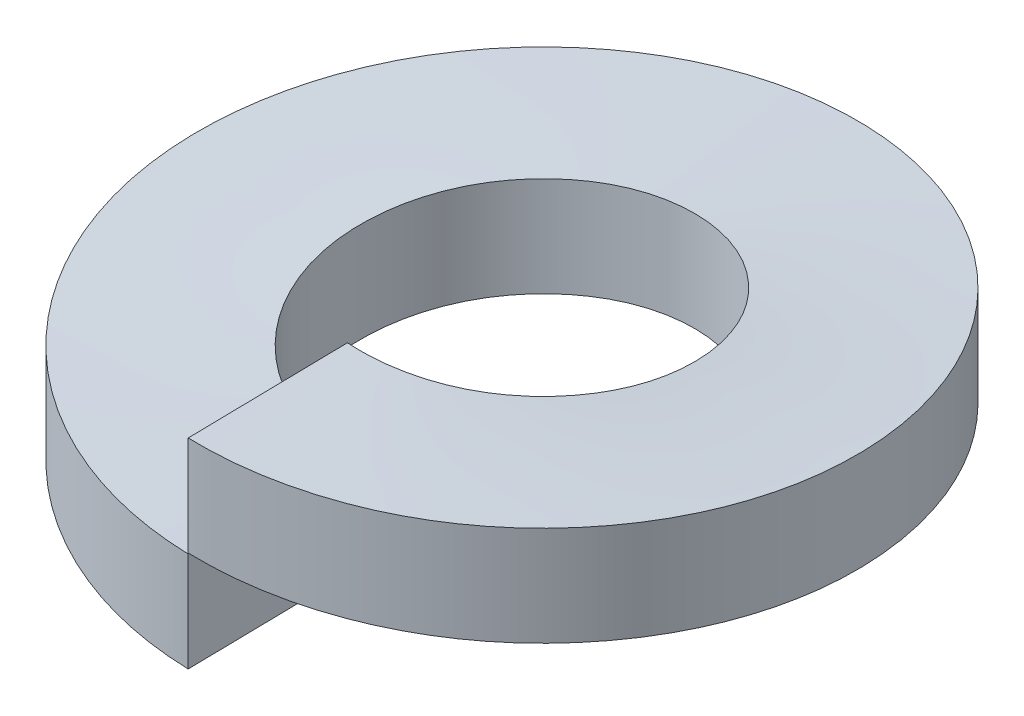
ISO-10303-21;
HEADER;
FILE_DESCRIPTION(('STEP AP214'),'2;1');
FILE_NAME('part.step','',(''),(''),'','','');
FILE_SCHEMA(('AUTOMOTIVE_DESIGN { 1 0 10303 214 1 1 1 1 }'));
ENDSEC;
DATA;
#1=APPLICATION_CONTEXT('core data for automotive mechanical design processes');
#2=APPLICATION_PROTOCOL_DEFINITION('international standard','automotive_design',2000,#1);
#3=PRODUCT_CONTEXT('',#1,'mechanical');
#4=PRODUCT('Part','Part','',(#3));
#5=PRODUCT_RELATED_PRODUCT_CATEGORY('part','',(#4));
#6=PRODUCT_DEFINITION_FORMATION('','',#4);
#7=PRODUCT_DEFINITION_CONTEXT('part definition',#1,'design');
#8=PRODUCT_DEFINITION('design','',#6,#7);
#9=PRODUCT_DEFINITION_SHAPE('','',#8);
#10=(LENGTH_UNIT() NAMED_UNIT(*) SI_UNIT(.MILLI.,.METRE.));
#11=(NAMED_UNIT(*) PLANE_ANGLE_UNIT() SI_UNIT($,.RADIAN.));
#12=(NAMED_UNIT(*) SI_UNIT($,.STERADIAN.) SOLID_ANGLE_UNIT());
#13=UNCERTAINTY_MEASURE_WITH_UNIT(LENGTH_MEASURE(1.E-05),#10,'distance_accuracy_value','');
#14=(GEOMETRIC_REPRESENTATION_CONTEXT(3) GLOBAL_UNCERTAINTY_ASSIGNED_CONTEXT((#13)) GLOBAL_UNIT_ASSIGNED_CONTEXT((#10,
#11,#12)) REPRESENTATION_CONTEXT('',''));
#15=CARTESIAN_POINT('',(0.,0.,0.));
#16=DIRECTION('',(0.,0.,1.));
#17=DIRECTION('',(1.,0.,0.));
#18=AXIS2_PLACEMENT_3D('',#15,#16,#17);
#19=CARTESIAN_POINT('',(0.0349050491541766,0.591666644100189,1.99969538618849));
#20=DIRECTION('',(0.999847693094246,0.,-0.0174525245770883));
#21=DIRECTION('',(-0.0174525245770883,0.,-0.999847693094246));
#22=AXIS2_PLACEMENT_3D('',#19,#20,#21);
#23=PLANE('',#22);
#24=DIRECTION('',(0.,1.,0.));
#25=VECTOR('',#24,1.);
#26=CARTESIAN_POINT('',(0.0349050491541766,0.591666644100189,1.99969538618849));
#27=LINE('',#26,#25);
#28=CARTESIAN_POINT('',(0.0349050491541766,-0.00333335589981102,1.99969538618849));
#29=VERTEX_POINT('',#28);
#30=CARTESIAN_POINT('',(0.0349050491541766,1.18666664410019,1.99969538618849));
#31=VERTEX_POINT('',#30);
#32=EDGE_CURVE('E44',#29,#31,#27,.T.);
#33=ORIENTED_EDGE('',*,*,#32,.T.);
#34=DIRECTION('',(0.0174525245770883,0.,0.999847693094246));
#35=VECTOR('',#34,1.);
#36=CARTESIAN_POINT('',(0.0518025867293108,1.18666664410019,2.96774811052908));
#37=LINE('',#36,#35);
#38=CARTESIAN_POINT('',(0.0687001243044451,1.18666664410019,3.93580083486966));
#39=VERTEX_POINT('',#38);
#40=EDGE_CURVE('E39',#31,#39,#37,.T.);
#41=ORIENTED_EDGE('',*,*,#40,.T.);
#42=DIRECTION('',(0.,-1.,0.));
#43=VECTOR('',#42,1.);
#44=CARTESIAN_POINT('',(0.0687001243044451,0.591666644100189,3.93580083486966));
#45=LINE('',#44,#43);
#46=CARTESIAN_POINT('',(0.0687001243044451,-0.00333335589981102,3.93580083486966));
#47=VERTEX_POINT('',#46);
#48=EDGE_CURVE('E79',#39,#47,#45,.T.);
#49=ORIENTED_EDGE('',*,*,#48,.T.);
#50=DIRECTION('',(-0.0174525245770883,0.,-0.999847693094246));
#51=VECTOR('',#50,1.);
#52=CARTESIAN_POINT('',(0.0518025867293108,-0.00333335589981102,2.96774811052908));
#53=LINE('',#52,#51);
#54=EDGE_CURVE('E60',#47,#29,#53,.T.);
#55=ORIENTED_EDGE('',*,*,#54,.T.);
#56=EDGE_LOOP('',(#33,#41,#49,#55));
#57=FACE_BOUND('',#56,.T.);
#58=ADVANCED_FACE('F35',(#57),#23,.T.);
#59=CARTESIAN_POINT('',(0.0349050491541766,1.79166664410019,1.99969538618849));
#60=DIRECTION('',(-0.999847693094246,0.,0.0174525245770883));
#61=DIRECTION('',(0.0174525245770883,0.,0.999847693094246));
#62=AXIS2_PLACEMENT_3D('',#59,#60,#61);
#63=PLANE('',#62);
#64=DIRECTION('',(0.,-1.,0.));
#65=VECTOR('',#64,1.);
#66=CARTESIAN_POINT('',(0.0349050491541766,1.79166664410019,1.99969538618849));
#67=LINE('',#66,#65);
#68=CARTESIAN_POINT('',(0.0349050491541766,2.38666664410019,1.99969538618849));
#69=VERTEX_POINT('',#68);
#70=CARTESIAN_POINT('',(0.0349050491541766,1.19666664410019,1.99969538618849));
#71=VERTEX_POINT('',#70);
#72=EDGE_CURVE('E11',#69,#71,#67,.T.);
#73=ORIENTED_EDGE('',*,*,#72,.T.);
#74=DIRECTION('',(0.0174525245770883,0.,0.999847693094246));
#75=VECTOR('',#74,1.);
#76=CARTESIAN_POINT('',(0.0518025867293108,1.19666664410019,2.96774811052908));
#77=LINE('',#76,#75);
#78=CARTESIAN_POINT('',(0.0687001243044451,1.19666664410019,3.93580083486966));
#79=VERTEX_POINT('',#78);
#80=EDGE_CURVE('E184',#71,#79,#77,.T.);
#81=ORIENTED_EDGE('',*,*,#80,.T.);
#82=DIRECTION('',(0.,1.,0.));
#83=VECTOR('',#82,1.);
#84=CARTESIAN_POINT('',(0.0687001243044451,1.79166664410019,3.93580083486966));
#85=LINE('',#84,#83);
#86=CARTESIAN_POINT('',(0.0687001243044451,2.38666664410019,3.93580083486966));
#87=VERTEX_POINT('',#86);
#88=EDGE_CURVE('E96',#79,#87,#85,.T.);
#89=ORIENTED_EDGE('',*,*,#88,.T.);
#90=DIRECTION('',(-0.0174525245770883,0.,-0.999847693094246));
#91=VECTOR('',#90,1.);
#92=CARTESIAN_POINT('',(0.0518025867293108,2.38666664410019,2.96774811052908));
#93=LINE('',#92,#91);
#94=EDGE_CURVE('E84',#87,#69,#93,.T.);
#95=ORIENTED_EDGE('',*,*,#94,.T.);
#96=EDGE_LOOP('',(#73,#81,#89,#95));
#97=FACE_BOUND('',#96,.T.);
#98=ADVANCED_FACE('F37',(#97),#63,.T.);
#99=CARTESIAN_POINT('',(0.0349050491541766,-0.00333335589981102,1.99969538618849));
#100=CARTESIAN_POINT('',(-0.793395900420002,0.071666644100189,2.01415353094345));
#101=CARTESIAN_POINT('',(-1.38931657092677,0.146666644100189,1.4386797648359));
#102=CARTESIAN_POINT('',(-1.98523724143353,0.221666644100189,0.863205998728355));
#103=CARTESIAN_POINT('',(-1.99969538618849,0.296666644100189,0.0349050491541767));
#104=CARTESIAN_POINT('',(-2.01415353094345,0.371666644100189,-0.793395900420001));
#105=CARTESIAN_POINT('',(-1.4386797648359,0.446666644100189,-1.38931657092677));
#106=CARTESIAN_POINT('',(-0.863205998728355,0.521666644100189,-1.98523724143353));
#107=CARTESIAN_POINT('',(-0.0349050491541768,0.596666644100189,-1.99969538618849));
#108=CARTESIAN_POINT('',(0.793395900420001,0.671666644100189,-2.01415353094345));
#109=CARTESIAN_POINT('',(1.38931657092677,0.746666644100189,-1.4386797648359));
#110=CARTESIAN_POINT('',(1.98523724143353,0.821666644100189,-0.863205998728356));
#111=CARTESIAN_POINT('',(1.99969538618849,0.896666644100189,-0.0349050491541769));
#112=CARTESIAN_POINT('',(2.01415353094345,0.971666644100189,0.793395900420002));
#113=CARTESIAN_POINT('',(1.4386797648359,1.04666664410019,1.38931657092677));
#114=CARTESIAN_POINT('',(0.863205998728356,1.12166664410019,1.98523724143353));
#115=CARTESIAN_POINT('',(0.0349050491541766,1.19666664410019,1.99969538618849));
#116=CARTESIAN_POINT('',(0.0349050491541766,1.18666664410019,1.99969538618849));
#117=CARTESIAN_POINT('',(-0.793395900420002,1.26166664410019,2.01415353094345));
#118=CARTESIAN_POINT('',(-1.38931657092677,1.33666664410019,1.4386797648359));
#119=CARTESIAN_POINT('',(-1.98523724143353,1.41166664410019,0.863205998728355));
#120=CARTESIAN_POINT('',(-1.99969538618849,1.48666664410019,0.0349050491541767));
#121=CARTESIAN_POINT('',(-2.01415353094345,1.56166664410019,-0.793395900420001));
#122=CARTESIAN_POINT('',(-1.4386797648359,1.63666664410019,-1.38931657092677));
#123=CARTESIAN_POINT('',(-0.863205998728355,1.71166664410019,-1.98523724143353));
#124=CARTESIAN_POINT('',(-0.0349050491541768,1.78666664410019,-1.99969538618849));
#125=CARTESIAN_POINT('',(0.793395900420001,1.86166664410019,-2.01415353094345));
#126=CARTESIAN_POINT('',(1.38931657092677,1.93666664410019,-1.4386797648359));
#127=CARTESIAN_POINT('',(1.98523724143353,2.01166664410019,-0.863205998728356));
#128=CARTESIAN_POINT('',(1.99969538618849,2.08666664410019,-0.0349050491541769));
#129=CARTESIAN_POINT('',(2.01415353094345,2.16166664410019,0.793395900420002));
#130=CARTESIAN_POINT('',(1.4386797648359,2.23666664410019,1.38931657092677));
#131=CARTESIAN_POINT('',(0.863205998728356,2.31166664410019,1.98523724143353));
#132=CARTESIAN_POINT('',(0.0349050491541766,2.38666664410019,1.99969538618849));
#133=(BOUNDED_SURFACE() B_SPLINE_SURFACE(1,2,((#99,#100,#101,#102,#103,#104,#105,#106,#107,#108,
#109,#110,#111,#112,#113,#114,#115),(#116,#117,#118,#119,#120,#121,#122,#123,#124,#125,#126,
#127,#128,#129,#130,#131,#132)),.UNSPECIFIED.,.F.,.F.,.F.) B_SPLINE_SURFACE_WITH_KNOTS((2,2),(3,
2,2,2,2,2,2,2,3),(0.,1.),(0.,0.125,0.25,0.375,0.5,0.625,0.75,0.875,1.),
.UNSPECIFIED.) GEOMETRIC_REPRESENTATION_ITEM() RATIONAL_B_SPLINE_SURFACE(((1.,0.923879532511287,
1.,0.923879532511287,1.,0.923879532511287,1.,0.923879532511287,1.,0.923879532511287,1.,
0.923879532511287,1.,0.923879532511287,1.,0.923879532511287,1.),(1.,0.923879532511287,1.,
0.923879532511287,1.,0.923879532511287,1.,0.923879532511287,1.,0.923879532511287,1.,
0.923879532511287,1.,0.923879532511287,1.,0.923879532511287,1.))) REPRESENTATION_ITEM('') SURFACE());
#134=CARTESIAN_POINT('',(0.0349050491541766,-0.00333335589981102,1.99969538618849));
#135=CARTESIAN_POINT('',(-0.793395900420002,0.071666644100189,2.01415353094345));
#136=CARTESIAN_POINT('',(-1.38931657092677,0.146666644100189,1.4386797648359));
#137=CARTESIAN_POINT('',(-1.98523724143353,0.221666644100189,0.863205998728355));
#138=CARTESIAN_POINT('',(-1.99969538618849,0.296666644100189,0.0349050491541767));
#139=CARTESIAN_POINT('',(-2.01415353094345,0.371666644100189,-0.793395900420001));
#140=CARTESIAN_POINT('',(-1.4386797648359,0.446666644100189,-1.38931657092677));
#141=CARTESIAN_POINT('',(-0.863205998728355,0.521666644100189,-1.98523724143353));
#142=CARTESIAN_POINT('',(-0.0349050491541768,0.596666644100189,-1.99969538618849));
#143=CARTESIAN_POINT('',(0.793395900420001,0.671666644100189,-2.01415353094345));
#144=CARTESIAN_POINT('',(1.38931657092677,0.746666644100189,-1.4386797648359));
#145=CARTESIAN_POINT('',(1.98523724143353,0.821666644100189,-0.863205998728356));
#146=CARTESIAN_POINT('',(1.99969538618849,0.896666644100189,-0.0349050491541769));
#147=CARTESIAN_POINT('',(2.01415353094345,0.971666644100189,0.793395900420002));
#148=CARTESIAN_POINT('',(1.4386797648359,1.04666664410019,1.38931657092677));
#149=CARTESIAN_POINT('',(0.863205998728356,1.12166664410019,1.98523724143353));
#150=CARTESIAN_POINT('',(0.0349050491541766,1.19666664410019,1.99969538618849));
#151=(BOUNDED_CURVE() B_SPLINE_CURVE(2,(#134,#135,#136,#137,#138,#139,#140,#141,#142,#143,#144,
#145,#146,#147,#148,#149,#150),.UNSPECIFIED.,.F.,.F.) B_SPLINE_CURVE_WITH_KNOTS((3,2,2,2,2,2,2,
2,3),(0.,0.125,0.25,0.375,0.5,0.625,0.75,0.875,1.),
.UNSPECIFIED.) CURVE() GEOMETRIC_REPRESENTATION_ITEM() RATIONAL_B_SPLINE_CURVE((1.,
0.923879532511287,1.,0.923879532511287,1.,0.923879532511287,1.,0.923879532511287,1.,
0.923879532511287,1.,0.923879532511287,1.,0.923879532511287,1.,0.923879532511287,1.)) REPRESENTATION_ITEM(''));
#152=EDGE_CURVE('E52',#29,#71,#151,.T.);
#153=CARTESIAN_POINT('',(0.0349050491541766,1.18666664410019,1.99969538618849));
#154=CARTESIAN_POINT('',(-0.793395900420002,1.26166664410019,2.01415353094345));
#155=CARTESIAN_POINT('',(-1.38931657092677,1.33666664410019,1.4386797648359));
#156=CARTESIAN_POINT('',(-1.98523724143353,1.41166664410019,0.863205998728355));
#157=CARTESIAN_POINT('',(-1.99969538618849,1.48666664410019,0.0349050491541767));
#158=CARTESIAN_POINT('',(-2.01415353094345,1.56166664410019,-0.793395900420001));
#159=CARTESIAN_POINT('',(-1.4386797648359,1.63666664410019,-1.38931657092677));
#160=CARTESIAN_POINT('',(-0.863205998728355,1.71166664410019,-1.98523724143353));
#161=CARTESIAN_POINT('',(-0.0349050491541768,1.78666664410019,-1.99969538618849));
#162=CARTESIAN_POINT('',(0.793395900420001,1.86166664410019,-2.01415353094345));
#163=CARTESIAN_POINT('',(1.38931657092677,1.93666664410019,-1.4386797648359));
#164=CARTESIAN_POINT('',(1.98523724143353,2.01166664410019,-0.863205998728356));
#165=CARTESIAN_POINT('',(1.99969538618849,2.08666664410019,-0.0349050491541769));
#166=CARTESIAN_POINT('',(2.01415353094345,2.16166664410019,0.793395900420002));
#167=CARTESIAN_POINT('',(1.4386797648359,2.23666664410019,1.38931657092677));
#168=CARTESIAN_POINT('',(0.863205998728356,2.31166664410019,1.98523724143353));
#169=CARTESIAN_POINT('',(0.0349050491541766,2.38666664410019,1.99969538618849));
#170=(BOUNDED_CURVE() B_SPLINE_CURVE(2,(#153,#154,#155,#156,#157,#158,#159,#160,#161,#162,#163,
#164,#165,#166,#167,#168,#169),.UNSPECIFIED.,.F.,.F.) B_SPLINE_CURVE_WITH_KNOTS((3,2,2,2,2,2,2,
2,3),(0.,0.125,0.25,0.375,0.5,0.625,0.75,0.875,1.),
.UNSPECIFIED.) CURVE() GEOMETRIC_REPRESENTATION_ITEM() RATIONAL_B_SPLINE_CURVE((1.,
0.923879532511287,1.,0.923879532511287,1.,0.923879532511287,1.,0.923879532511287,1.,
0.923879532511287,1.,0.923879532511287,1.,0.923879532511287,1.,0.923879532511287,1.)) REPRESENTATION_ITEM(''));
#171=EDGE_CURVE('E91',#31,#69,#170,.T.);
#172=ORIENTED_EDGE('',*,*,#32,.F.);
#173=ORIENTED_EDGE('',*,*,#152,.T.);
#174=ORIENTED_EDGE('',*,*,#72,.F.);
#175=ORIENTED_EDGE('',*,*,#171,.F.);
#176=EDGE_LOOP('',(#172,#173,#174,#175));
#177=FACE_BOUND('',#176,.T.);
#178=ADVANCED_FACE('F103',(#177),#133,.F.);
#179=CARTESIAN_POINT('',(0.0687001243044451,-0.00333335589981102,3.93580083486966));
#180=CARTESIAN_POINT('',(-1.56156196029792,0.071666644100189,3.96425735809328));
#181=CARTESIAN_POINT('',(-2.73445313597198,0.146666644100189,2.83160978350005));
#182=CARTESIAN_POINT('',(-3.90734431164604,0.221666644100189,1.69896220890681));
#183=CARTESIAN_POINT('',(-3.93580083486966,0.296666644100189,0.0687001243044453));
#184=CARTESIAN_POINT('',(-3.96425735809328,0.371666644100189,-1.56156196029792));
#185=CARTESIAN_POINT('',(-2.83160978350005,0.446666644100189,-2.73445313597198));
#186=CARTESIAN_POINT('',(-1.69896220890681,0.521666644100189,-3.90734431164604));
#187=CARTESIAN_POINT('',(-0.0687001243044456,0.596666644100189,-3.93580083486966));
#188=CARTESIAN_POINT('',(1.56156196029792,0.671666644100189,-3.96425735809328));
#189=CARTESIAN_POINT('',(2.73445313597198,0.746666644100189,-2.83160978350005));
#190=CARTESIAN_POINT('',(3.90734431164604,0.821666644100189,-1.69896220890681));
#191=CARTESIAN_POINT('',(3.93580083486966,0.896666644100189,-0.0687001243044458));
#192=CARTESIAN_POINT('',(3.96425735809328,0.971666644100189,1.56156196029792));
#193=CARTESIAN_POINT('',(2.83160978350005,1.04666664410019,2.73445313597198));
#194=CARTESIAN_POINT('',(1.69896220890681,1.12166664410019,3.90734431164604));
#195=CARTESIAN_POINT('',(0.0687001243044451,1.19666664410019,3.93580083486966));
#196=CARTESIAN_POINT('',(0.0349050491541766,-0.00333335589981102,1.99969538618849));
#197=CARTESIAN_POINT('',(-0.793395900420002,0.071666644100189,2.01415353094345));
#198=CARTESIAN_POINT('',(-1.38931657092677,0.146666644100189,1.4386797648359));
#199=CARTESIAN_POINT('',(-1.98523724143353,0.221666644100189,0.863205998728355));
#200=CARTESIAN_POINT('',(-1.99969538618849,0.296666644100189,0.0349050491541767));
#201=CARTESIAN_POINT('',(-2.01415353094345,0.371666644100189,-0.793395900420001));
#202=CARTESIAN_POINT('',(-1.4386797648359,0.446666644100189,-1.38931657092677));
#203=CARTESIAN_POINT('',(-0.863205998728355,0.521666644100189,-1.98523724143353));
#204=CARTESIAN_POINT('',(-0.0349050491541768,0.596666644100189,-1.99969538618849));
#205=CARTESIAN_POINT('',(0.793395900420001,0.671666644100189,-2.01415353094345));
#206=CARTESIAN_POINT('',(1.38931657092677,0.746666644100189,-1.4386797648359));
#207=CARTESIAN_POINT('',(1.98523724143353,0.821666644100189,-0.863205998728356));
#208=CARTESIAN_POINT('',(1.99969538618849,0.896666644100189,-0.0349050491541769));
#209=CARTESIAN_POINT('',(2.01415353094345,0.971666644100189,0.793395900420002));
#210=CARTESIAN_POINT('',(1.4386797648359,1.04666664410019,1.38931657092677));
#211=CARTESIAN_POINT('',(0.863205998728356,1.12166664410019,1.98523724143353));
#212=CARTESIAN_POINT('',(0.0349050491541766,1.19666664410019,1.99969538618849));
#213=(BOUNDED_SURFACE() B_SPLINE_SURFACE(1,2,((#179,#180,#181,#182,#183,#184,#185,#186,#187,
#188,#189,#190,#191,#192,#193,#194,#195),(#196,#197,#198,#199,#200,#201,#202,#203,#204,#205,
#206,#207,#208,#209,#210,#211,#212)),.UNSPECIFIED.,.F.,.F.,.F.) B_SPLINE_SURFACE_WITH_KNOTS((2,
2),(3,2,2,2,2,2,2,2,3),(0.,1.),(0.,0.125,0.25,0.375,0.5,0.625,0.75,0.875,1.),
.UNSPECIFIED.) GEOMETRIC_REPRESENTATION_ITEM() RATIONAL_B_SPLINE_SURFACE(((1.,0.923879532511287,
1.,0.923879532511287,1.,0.923879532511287,1.,0.923879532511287,1.,0.923879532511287,1.,
0.923879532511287,1.,0.923879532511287,1.,0.923879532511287,1.),(1.,0.923879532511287,1.,
0.923879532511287,1.,0.923879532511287,1.,0.923879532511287,1.,0.923879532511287,1.,
0.923879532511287,1.,0.923879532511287,1.,0.923879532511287,1.))) REPRESENTATION_ITEM('') SURFACE());
#214=CARTESIAN_POINT('',(0.0687001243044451,-0.00333335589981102,3.93580083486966));
#215=CARTESIAN_POINT('',(-1.56156196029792,0.071666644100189,3.96425735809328));
#216=CARTESIAN_POINT('',(-2.73445313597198,0.146666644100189,2.83160978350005));
#217=CARTESIAN_POINT('',(-3.90734431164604,0.221666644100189,1.69896220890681));
#218=CARTESIAN_POINT('',(-3.93580083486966,0.296666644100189,0.0687001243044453));
#219=CARTESIAN_POINT('',(-3.96425735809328,0.371666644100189,-1.56156196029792));
#220=CARTESIAN_POINT('',(-2.83160978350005,0.446666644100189,-2.73445313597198));
#221=CARTESIAN_POINT('',(-1.69896220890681,0.521666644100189,-3.90734431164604));
#222=CARTESIAN_POINT('',(-0.0687001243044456,0.596666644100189,-3.93580083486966));
#223=CARTESIAN_POINT('',(1.56156196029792,0.671666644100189,-3.96425735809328));
#224=CARTESIAN_POINT('',(2.73445313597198,0.746666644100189,-2.83160978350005));
#225=CARTESIAN_POINT('',(3.90734431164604,0.821666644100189,-1.69896220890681));
#226=CARTESIAN_POINT('',(3.93580083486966,0.896666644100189,-0.0687001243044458));
#227=CARTESIAN_POINT('',(3.96425735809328,0.971666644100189,1.56156196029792));
#228=CARTESIAN_POINT('',(2.83160978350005,1.04666664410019,2.73445313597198));
#229=CARTESIAN_POINT('',(1.69896220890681,1.12166664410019,3.90734431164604));
#230=CARTESIAN_POINT('',(0.0687001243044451,1.19666664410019,3.93580083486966));
#231=(BOUNDED_CURVE() B_SPLINE_CURVE(2,(#214,#215,#216,#217,#218,#219,#220,#221,#222,#223,#224,
#225,#226,#227,#228,#229,#230),.UNSPECIFIED.,.F.,.F.) B_SPLINE_CURVE_WITH_KNOTS((3,2,2,2,2,2,2,
2,3),(0.,0.125,0.25,0.375,0.5,0.625,0.75,0.875,1.),
.UNSPECIFIED.) CURVE() GEOMETRIC_REPRESENTATION_ITEM() RATIONAL_B_SPLINE_CURVE((1.,
0.923879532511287,1.,0.923879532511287,1.,0.923879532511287,1.,0.923879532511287,1.,
0.923879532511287,1.,0.923879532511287,1.,0.923879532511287,1.,0.923879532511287,1.)) REPRESENTATION_ITEM(''));
#232=EDGE_CURVE('E94',#47,#79,#231,.T.);
#233=ORIENTED_EDGE('',*,*,#54,.F.);
#234=ORIENTED_EDGE('',*,*,#232,.T.);
#235=ORIENTED_EDGE('',*,*,#80,.F.);
#236=ORIENTED_EDGE('',*,*,#152,.F.);
#237=EDGE_LOOP('',(#233,#234,#235,#236));
#238=FACE_BOUND('',#237,.T.);
#239=ADVANCED_FACE('F105',(#238),#213,.F.);
#240=CARTESIAN_POINT('',(0.0687001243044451,1.18666664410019,3.93580083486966));
#241=CARTESIAN_POINT('',(-1.56156196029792,1.26166664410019,3.96425735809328));
#242=CARTESIAN_POINT('',(-2.73445313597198,1.33666664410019,2.83160978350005));
#243=CARTESIAN_POINT('',(-3.90734431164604,1.41166664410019,1.69896220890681));
#244=CARTESIAN_POINT('',(-3.93580083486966,1.48666664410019,0.0687001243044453));
#245=CARTESIAN_POINT('',(-3.96425735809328,1.56166664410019,-1.56156196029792));
#246=CARTESIAN_POINT('',(-2.83160978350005,1.63666664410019,-2.73445313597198));
#247=CARTESIAN_POINT('',(-1.69896220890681,1.71166664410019,-3.90734431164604));
#248=CARTESIAN_POINT('',(-0.0687001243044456,1.78666664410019,-3.93580083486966));
#249=CARTESIAN_POINT('',(1.56156196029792,1.86166664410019,-3.96425735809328));
#250=CARTESIAN_POINT('',(2.73445313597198,1.93666664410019,-2.83160978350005));
#251=CARTESIAN_POINT('',(3.90734431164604,2.01166664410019,-1.69896220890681));
#252=CARTESIAN_POINT('',(3.93580083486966,2.08666664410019,-0.0687001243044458));
#253=CARTESIAN_POINT('',(3.96425735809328,2.16166664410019,1.56156196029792));
#254=CARTESIAN_POINT('',(2.83160978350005,2.23666664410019,2.73445313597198));
#255=CARTESIAN_POINT('',(1.69896220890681,2.31166664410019,3.90734431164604));
#256=CARTESIAN_POINT('',(0.0687001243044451,2.38666664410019,3.93580083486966));
#257=CARTESIAN_POINT('',(0.0687001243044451,-0.00333335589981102,3.93580083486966));
#258=CARTESIAN_POINT('',(-1.56156196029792,0.071666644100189,3.96425735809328));
#259=CARTESIAN_POINT('',(-2.73445313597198,0.146666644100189,2.83160978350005));
#260=CARTESIAN_POINT('',(-3.90734431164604,0.221666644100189,1.69896220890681));
#261=CARTESIAN_POINT('',(-3.93580083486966,0.296666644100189,0.0687001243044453));
#262=CARTESIAN_POINT('',(-3.96425735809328,0.371666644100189,-1.56156196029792));
#263=CARTESIAN_POINT('',(-2.83160978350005,0.446666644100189,-2.73445313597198));
#264=CARTESIAN_POINT('',(-1.69896220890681,0.521666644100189,-3.90734431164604));
#265=CARTESIAN_POINT('',(-0.0687001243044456,0.596666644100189,-3.93580083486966));
#266=CARTESIAN_POINT('',(1.56156196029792,0.671666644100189,-3.96425735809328));
#267=CARTESIAN_POINT('',(2.73445313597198,0.746666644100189,-2.83160978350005));
#268=CARTESIAN_POINT('',(3.90734431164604,0.821666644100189,-1.69896220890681));
#269=CARTESIAN_POINT('',(3.93580083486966,0.896666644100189,-0.0687001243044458));
#270=CARTESIAN_POINT('',(3.96425735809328,0.971666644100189,1.56156196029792));
#271=CARTESIAN_POINT('',(2.83160978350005,1.04666664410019,2.73445313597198));
#272=CARTESIAN_POINT('',(1.69896220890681,1.12166664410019,3.90734431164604));
#273=CARTESIAN_POINT('',(0.0687001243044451,1.19666664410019,3.93580083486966));
#274=(BOUNDED_SURFACE() B_SPLINE_SURFACE(1,2,((#240,#241,#242,#243,#244,#245,#246,#247,#248,
#249,#250,#251,#252,#253,#254,#255,#256),(#257,#258,#259,#260,#261,#262,#263,#264,#265,#266,
#267,#268,#269,#270,#271,#272,#273)),.UNSPECIFIED.,.F.,.F.,.F.) B_SPLINE_SURFACE_WITH_KNOTS((2,
2),(3,2,2,2,2,2,2,2,3),(0.,1.),(0.,0.125,0.25,0.375,0.5,0.625,0.75,0.875,1.),
.UNSPECIFIED.) GEOMETRIC_REPRESENTATION_ITEM() RATIONAL_B_SPLINE_SURFACE(((1.,0.923879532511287,
1.,0.923879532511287,1.,0.923879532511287,1.,0.923879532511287,1.,0.923879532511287,1.,
0.923879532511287,1.,0.923879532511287,1.,0.923879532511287,1.),(1.,0.923879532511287,1.,
0.923879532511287,1.,0.923879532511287,1.,0.923879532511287,1.,0.923879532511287,1.,
0.923879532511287,1.,0.923879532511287,1.,0.923879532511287,1.))) REPRESENTATION_ITEM('') SURFACE());
#275=CARTESIAN_POINT('',(0.0687001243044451,1.18666664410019,3.93580083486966));
#276=CARTESIAN_POINT('',(-1.56156196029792,1.26166664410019,3.96425735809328));
#277=CARTESIAN_POINT('',(-2.73445313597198,1.33666664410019,2.83160978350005));
#278=CARTESIAN_POINT('',(-3.90734431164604,1.41166664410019,1.69896220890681));
#279=CARTESIAN_POINT('',(-3.93580083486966,1.48666664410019,0.0687001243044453));
#280=CARTESIAN_POINT('',(-3.96425735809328,1.56166664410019,-1.56156196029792));
#281=CARTESIAN_POINT('',(-2.83160978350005,1.63666664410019,-2.73445313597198));
#282=CARTESIAN_POINT('',(-1.69896220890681,1.71166664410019,-3.90734431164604));
#283=CARTESIAN_POINT('',(-0.0687001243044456,1.78666664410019,-3.93580083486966));
#284=CARTESIAN_POINT('',(1.56156196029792,1.86166664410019,-3.96425735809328));
#285=CARTESIAN_POINT('',(2.73445313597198,1.93666664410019,-2.83160978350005));
#286=CARTESIAN_POINT('',(3.90734431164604,2.01166664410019,-1.69896220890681));
#287=CARTESIAN_POINT('',(3.93580083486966,2.08666664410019,-0.0687001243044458));
#288=CARTESIAN_POINT('',(3.96425735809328,2.16166664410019,1.56156196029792));
#289=CARTESIAN_POINT('',(2.83160978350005,2.23666664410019,2.73445313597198));
#290=CARTESIAN_POINT('',(1.69896220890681,2.31166664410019,3.90734431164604));
#291=CARTESIAN_POINT('',(0.0687001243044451,2.38666664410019,3.93580083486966));
#292=(BOUNDED_CURVE() B_SPLINE_CURVE(2,(#275,#276,#277,#278,#279,#280,#281,#282,#283,#284,#285,
#286,#287,#288,#289,#290,#291),.UNSPECIFIED.,.F.,.F.) B_SPLINE_CURVE_WITH_KNOTS((3,2,2,2,2,2,2,
2,3),(0.,0.125,0.25,0.375,0.5,0.625,0.75,0.875,1.),
.UNSPECIFIED.) CURVE() GEOMETRIC_REPRESENTATION_ITEM() RATIONAL_B_SPLINE_CURVE((1.,
0.923879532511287,1.,0.923879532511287,1.,0.923879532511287,1.,0.923879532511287,1.,
0.923879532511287,1.,0.923879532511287,1.,0.923879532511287,1.,0.923879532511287,1.)) REPRESENTATION_ITEM(''));
#293=EDGE_CURVE('E86',#39,#87,#292,.T.);
#294=ORIENTED_EDGE('',*,*,#48,.F.);
#295=ORIENTED_EDGE('',*,*,#293,.T.);
#296=ORIENTED_EDGE('',*,*,#88,.F.);
#297=ORIENTED_EDGE('',*,*,#232,.F.);
#298=EDGE_LOOP('',(#294,#295,#296,#297));
#299=FACE_BOUND('',#298,.T.);
#300=ADVANCED_FACE('F93',(#299),#274,.F.);
#301=CARTESIAN_POINT('',(0.0349050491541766,1.18666664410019,1.99969538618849));
#302=CARTESIAN_POINT('',(-0.793395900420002,1.26166664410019,2.01415353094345));
#303=CARTESIAN_POINT('',(-1.38931657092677,1.33666664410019,1.4386797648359));
#304=CARTESIAN_POINT('',(-1.98523724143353,1.41166664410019,0.863205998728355));
#305=CARTESIAN_POINT('',(-1.99969538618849,1.48666664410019,0.0349050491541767));
#306=CARTESIAN_POINT('',(-2.01415353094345,1.56166664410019,-0.793395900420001));
#307=CARTESIAN_POINT('',(-1.4386797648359,1.63666664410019,-1.38931657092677));
#308=CARTESIAN_POINT('',(-0.863205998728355,1.71166664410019,-1.98523724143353));
#309=CARTESIAN_POINT('',(-0.0349050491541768,1.78666664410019,-1.99969538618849));
#310=CARTESIAN_POINT('',(0.793395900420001,1.86166664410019,-2.01415353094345));
#311=CARTESIAN_POINT('',(1.38931657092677,1.93666664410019,-1.4386797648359));
#312=CARTESIAN_POINT('',(1.98523724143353,2.01166664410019,-0.863205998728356));
#313=CARTESIAN_POINT('',(1.99969538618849,2.08666664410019,-0.0349050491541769));
#314=CARTESIAN_POINT('',(2.01415353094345,2.16166664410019,0.793395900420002));
#315=CARTESIAN_POINT('',(1.4386797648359,2.23666664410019,1.38931657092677));
#316=CARTESIAN_POINT('',(0.863205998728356,2.31166664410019,1.98523724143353));
#317=CARTESIAN_POINT('',(0.0349050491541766,2.38666664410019,1.99969538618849));
#318=CARTESIAN_POINT('',(0.0687001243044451,1.18666664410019,3.93580083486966));
#319=CARTESIAN_POINT('',(-1.56156196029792,1.26166664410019,3.96425735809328));
#320=CARTESIAN_POINT('',(-2.73445313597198,1.33666664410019,2.83160978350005));
#321=CARTESIAN_POINT('',(-3.90734431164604,1.41166664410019,1.69896220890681));
#322=CARTESIAN_POINT('',(-3.93580083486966,1.48666664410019,0.0687001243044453));
#323=CARTESIAN_POINT('',(-3.96425735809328,1.56166664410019,-1.56156196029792));
#324=CARTESIAN_POINT('',(-2.83160978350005,1.63666664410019,-2.73445313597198));
#325=CARTESIAN_POINT('',(-1.69896220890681,1.71166664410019,-3.90734431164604));
#326=CARTESIAN_POINT('',(-0.0687001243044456,1.78666664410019,-3.93580083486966));
#327=CARTESIAN_POINT('',(1.56156196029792,1.86166664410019,-3.96425735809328));
#328=CARTESIAN_POINT('',(2.73445313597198,1.93666664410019,-2.83160978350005));
#329=CARTESIAN_POINT('',(3.90734431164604,2.01166664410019,-1.69896220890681));
#330=CARTESIAN_POINT('',(3.93580083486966,2.08666664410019,-0.0687001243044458));
#331=CARTESIAN_POINT('',(3.96425735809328,2.16166664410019,1.56156196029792));
#332=CARTESIAN_POINT('',(2.83160978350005,2.23666664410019,2.73445313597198));
#333=CARTESIAN_POINT('',(1.69896220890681,2.31166664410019,3.90734431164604));
#334=CARTESIAN_POINT('',(0.0687001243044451,2.38666664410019,3.93580083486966));
#335=(BOUNDED_SURFACE() B_SPLINE_SURFACE(1,2,((#301,#302,#303,#304,#305,#306,#307,#308,#309,
#310,#311,#312,#313,#314,#315,#316,#317),(#318,#319,#320,#321,#322,#323,#324,#325,#326,#327,
#328,#329,#330,#331,#332,#333,#334)),.UNSPECIFIED.,.F.,.F.,.F.) B_SPLINE_SURFACE_WITH_KNOTS((2,
2),(3,2,2,2,2,2,2,2,3),(0.,1.),(0.,0.125,0.25,0.375,0.5,0.625,0.75,0.875,1.),
.UNSPECIFIED.) GEOMETRIC_REPRESENTATION_ITEM() RATIONAL_B_SPLINE_SURFACE(((1.,0.923879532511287,
1.,0.923879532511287,1.,0.923879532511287,1.,0.923879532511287,1.,0.923879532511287,1.,
0.923879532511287,1.,0.923879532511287,1.,0.923879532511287,1.),(1.,0.923879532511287,1.,
0.923879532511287,1.,0.923879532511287,1.,0.923879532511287,1.,0.923879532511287,1.,
0.923879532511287,1.,0.923879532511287,1.,0.923879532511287,1.))) REPRESENTATION_ITEM('') SURFACE());
#336=ORIENTED_EDGE('',*,*,#40,.F.);
#337=ORIENTED_EDGE('',*,*,#171,.T.);
#338=ORIENTED_EDGE('',*,*,#94,.F.);
#339=ORIENTED_EDGE('',*,*,#293,.F.);
#340=EDGE_LOOP('',(#336,#337,#338,#339));
#341=FACE_BOUND('',#340,.T.);
#342=ADVANCED_FACE('F87',(#341),#335,.F.);
#343=CLOSED_SHELL('',(#58,#98,#178,#239,#300,#342));
#344=MANIFOLD_SOLID_BREP('B2',#343);
#345=ADVANCED_BREP_SHAPE_REPRESENTATION('',(#18,#344),#14);
#346=SHAPE_DEFINITION_REPRESENTATION(#9,#345);
ENDSEC;
END-ISO-10303-21;
